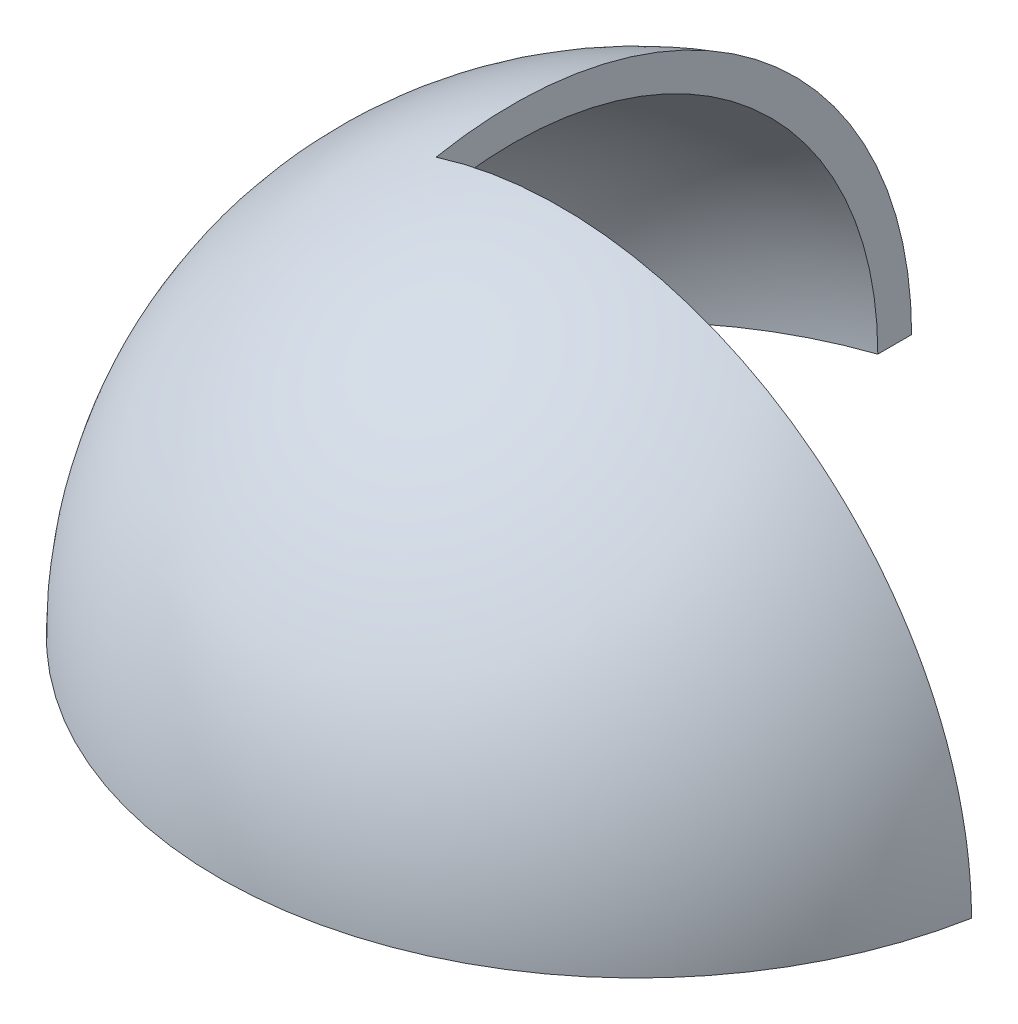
from build123d import *

# Parameters (mm, degrees)
REVOLVE3_ANGLE          = 180
CUT_EXTRUDE1_DEPTH      = 113.583302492
CUT_EXTRUDE1_DEPTH_BACK = 113.583302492
SKETCH2_W               = 87.409548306
SKETCH2_H               = 96.832137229


with BuildPart() as part:
    # Sketch1 → Revolve3 (revolve)
    with BuildSketch(Plane(origin=(0, 0, 0), x_dir=(1, 0, 0), z_dir=(0, 1, 0))):
        with BuildLine():
            Line((-60, 0), (-65, 0))
            ThreePointArc((-65, 0), (0, 65), (65, 0))
            Line((65, 0), (60, 0))
            ThreePointArc((60, 0), (0, 60), (-60, 0))
        make_face()
    revolve(axis=Axis((60, 0, 0), (1, 0, 0)), revolution_arc=REVOLVE3_ANGLE)

    # Sketch2 → Cut-Extrude1 (cut, two sides: drawn at the far end of the back side and taken through both)
    with BuildSketch(Plane(origin=(0, 0, 0), x_dir=(1, 0, 0), z_dir=(0, 1, 0)).offset(-CUT_EXTRUDE1_DEPTH_BACK)):
        with Locations((24.333306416, 36.496950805)):
            Rectangle(SKETCH2_W, SKETCH2_H)
    extrude(amount=CUT_EXTRUDE1_DEPTH + CUT_EXTRUDE1_DEPTH_BACK, mode=Mode.SUBTRACT)


solid = part.part
